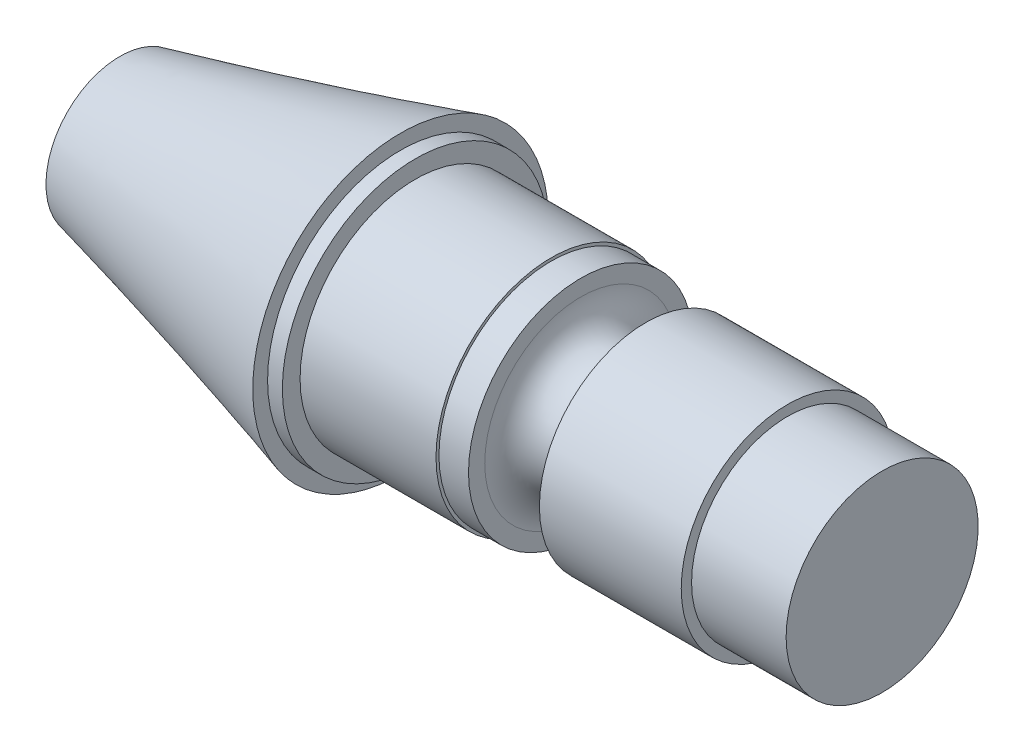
ISO-10303-21;
HEADER;
FILE_DESCRIPTION(('STEP AP214'),'2;1');
FILE_NAME('part.step','',(''),(''),'','','');
FILE_SCHEMA(('AUTOMOTIVE_DESIGN { 1 0 10303 214 1 1 1 1 }'));
ENDSEC;
DATA;
#1=APPLICATION_CONTEXT('core data for automotive mechanical design processes');
#2=APPLICATION_PROTOCOL_DEFINITION('international standard','automotive_design',2000,#1);
#3=PRODUCT_CONTEXT('',#1,'mechanical');
#4=PRODUCT('Part','Part','',(#3));
#5=PRODUCT_RELATED_PRODUCT_CATEGORY('part','',(#4));
#6=PRODUCT_DEFINITION_FORMATION('','',#4);
#7=PRODUCT_DEFINITION_CONTEXT('part definition',#1,'design');
#8=PRODUCT_DEFINITION('design','',#6,#7);
#9=PRODUCT_DEFINITION_SHAPE('','',#8);
#10=(LENGTH_UNIT() NAMED_UNIT(*) SI_UNIT(.MILLI.,.METRE.));
#11=(NAMED_UNIT(*) PLANE_ANGLE_UNIT() SI_UNIT($,.RADIAN.));
#12=(NAMED_UNIT(*) SI_UNIT($,.STERADIAN.) SOLID_ANGLE_UNIT());
#13=UNCERTAINTY_MEASURE_WITH_UNIT(LENGTH_MEASURE(1.E-05),#10,'distance_accuracy_value','');
#14=(GEOMETRIC_REPRESENTATION_CONTEXT(3) GLOBAL_UNCERTAINTY_ASSIGNED_CONTEXT((#13)) GLOBAL_UNIT_ASSIGNED_CONTEXT((#10,
#11,#12)) REPRESENTATION_CONTEXT('',''));
#15=CARTESIAN_POINT('',(0.,0.,0.));
#16=DIRECTION('',(0.,0.,1.));
#17=DIRECTION('',(1.,0.,0.));
#18=AXIS2_PLACEMENT_3D('',#15,#16,#17);
#19=CARTESIAN_POINT('',(163.,12.5,0.));
#20=DIRECTION('',(1.,0.,0.));
#21=DIRECTION('',(0.,0.,-1.));
#22=AXIS2_PLACEMENT_3D('',#19,#20,#21);
#23=PLANE('',#22);
#24=CARTESIAN_POINT('',(163.,45.,0.));
#25=DIRECTION('',(-1.,0.,0.));
#26=DIRECTION('',(0.,0.,1.));
#27=AXIS2_PLACEMENT_3D('',#24,#25,#26);
#28=CIRCLE('',#27,32.5);
#29=CARTESIAN_POINT('',(163.,45.,32.5));
#30=VERTEX_POINT('',#29);
#31=EDGE_CURVE('E11',#30,#30,#28,.T.);
#32=ORIENTED_EDGE('',*,*,#31,.F.);
#33=EDGE_LOOP('',(#32));
#34=FACE_BOUND('',#33,.T.);
#35=ADVANCED_FACE('F109',(#34),#23,.T.);
#36=CARTESIAN_POINT('',(-7.06911857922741,45.,0.));
#37=DIRECTION('',(-1.,0.,0.));
#38=DIRECTION('',(0.,0.,1.));
#39=AXIS2_PLACEMENT_3D('',#36,#37,#38);
#40=CYLINDRICAL_SURFACE('',#39,32.5);
#41=ORIENTED_EDGE('',*,*,#31,.T.);
#42=EDGE_LOOP('',(#41));
#43=FACE_BOUND('',#42,.T.);
#44=CARTESIAN_POINT('',(131.,45.,0.));
#45=DIRECTION('',(-1.,0.,0.));
#46=DIRECTION('',(0.,0.,1.));
#47=AXIS2_PLACEMENT_3D('',#44,#45,#46);
#48=CIRCLE('',#47,32.5);
#49=CARTESIAN_POINT('',(131.,45.,32.5));
#50=VERTEX_POINT('',#49);
#51=EDGE_CURVE('E120',#50,#50,#48,.T.);
#52=ORIENTED_EDGE('',*,*,#51,.F.);
#53=EDGE_LOOP('',(#52));
#54=FACE_BOUND('',#53,.T.);
#55=ADVANCED_FACE('F219',(#43,#54),#40,.T.);
#56=CARTESIAN_POINT('',(131.,9.,0.));
#57=DIRECTION('',(1.,0.,0.));
#58=DIRECTION('',(0.,0.,-1.));
#59=AXIS2_PLACEMENT_3D('',#56,#57,#58);
#60=PLANE('',#59);
#61=ORIENTED_EDGE('',*,*,#51,.T.);
#62=EDGE_LOOP('',(#61));
#63=FACE_BOUND('',#62,.T.);
#64=CARTESIAN_POINT('',(131.,45.,0.));
#65=DIRECTION('',(-1.,0.,0.));
#66=DIRECTION('',(0.,0.,1.));
#67=AXIS2_PLACEMENT_3D('',#64,#65,#66);
#68=CIRCLE('',#67,36.);
#69=CARTESIAN_POINT('',(131.,45.,36.));
#70=VERTEX_POINT('',#69);
#71=EDGE_CURVE('E124',#70,#70,#68,.T.);
#72=ORIENTED_EDGE('',*,*,#71,.F.);
#73=EDGE_LOOP('',(#72));
#74=FACE_BOUND('',#73,.T.);
#75=ADVANCED_FACE('F216',(#63,#74),#60,.T.);
#76=CARTESIAN_POINT('',(-7.06911857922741,45.,0.));
#77=DIRECTION('',(-1.,0.,0.));
#78=DIRECTION('',(0.,0.,1.));
#79=AXIS2_PLACEMENT_3D('',#76,#77,#78);
#80=CYLINDRICAL_SURFACE('',#79,36.);
#81=ORIENTED_EDGE('',*,*,#71,.T.);
#82=EDGE_LOOP('',(#81));
#83=FACE_BOUND('',#82,.T.);
#84=CARTESIAN_POINT('',(83.,45.,0.));
#85=DIRECTION('',(-1.,0.,0.));
#86=DIRECTION('',(0.,0.,1.));
#87=AXIS2_PLACEMENT_3D('',#84,#85,#86);
#88=CIRCLE('',#87,36.);
#89=CARTESIAN_POINT('',(83.,45.,36.));
#90=VERTEX_POINT('',#89);
#91=EDGE_CURVE('E129',#90,#90,#88,.T.);
#92=ORIENTED_EDGE('',*,*,#91,.F.);
#93=EDGE_LOOP('',(#92));
#94=FACE_BOUND('',#93,.T.);
#95=ADVANCED_FACE('F212',(#83,#94),#80,.T.);
#96=CARTESIAN_POINT('',(83.,12.5,0.));
#97=DIRECTION('',(-1.,0.,0.));
#98=DIRECTION('',(0.,0.,1.));
#99=AXIS2_PLACEMENT_3D('',#96,#97,#98);
#100=PLANE('',#99);
#101=ORIENTED_EDGE('',*,*,#91,.T.);
#102=EDGE_LOOP('',(#101));
#103=FACE_BOUND('',#102,.T.);
#104=CARTESIAN_POINT('',(83.,45.,0.));
#105=DIRECTION('',(-1.,0.,0.));
#106=DIRECTION('',(0.,0.,1.));
#107=AXIS2_PLACEMENT_3D('',#104,#105,#106);
#108=CIRCLE('',#107,32.5);
#109=CARTESIAN_POINT('',(83.,45.,32.5));
#110=VERTEX_POINT('',#109);
#111=EDGE_CURVE('E132',#110,#110,#108,.T.);
#112=ORIENTED_EDGE('',*,*,#111,.F.);
#113=EDGE_LOOP('',(#112));
#114=FACE_BOUND('',#113,.T.);
#115=ADVANCED_FACE('F208',(#103,#114),#100,.T.);
#116=CARTESIAN_POINT('',(72.,45.,0.));
#117=DIRECTION('',(-1.,0.,0.));
#118=DIRECTION('',(0.,0.,1.));
#119=AXIS2_PLACEMENT_3D('',#116,#117,#118);
#120=TOROIDAL_SURFACE('',#119,32.5,11.);
#121=ORIENTED_EDGE('',*,*,#111,.T.);
#122=EDGE_LOOP('',(#121));
#123=FACE_BOUND('',#122,.T.);
#124=CARTESIAN_POINT('',(61.,45.,0.));
#125=DIRECTION('',(-1.,0.,0.));
#126=DIRECTION('',(0.,0.,1.));
#127=AXIS2_PLACEMENT_3D('',#124,#125,#126);
#128=CIRCLE('',#127,32.5);
#129=CARTESIAN_POINT('',(61.,45.,32.5));
#130=VERTEX_POINT('',#129);
#131=EDGE_CURVE('E135',#130,#130,#128,.T.);
#132=ORIENTED_EDGE('',*,*,#131,.F.);
#133=EDGE_LOOP('',(#132));
#134=FACE_BOUND('',#133,.T.);
#135=ADVANCED_FACE('F204',(#123,#134),#120,.F.);
#136=CARTESIAN_POINT('',(61.,7.,0.));
#137=DIRECTION('',(1.,0.,0.));
#138=DIRECTION('',(0.,0.,-1.));
#139=AXIS2_PLACEMENT_3D('',#136,#137,#138);
#140=PLANE('',#139);
#141=ORIENTED_EDGE('',*,*,#131,.T.);
#142=EDGE_LOOP('',(#141));
#143=FACE_BOUND('',#142,.T.);
#144=CARTESIAN_POINT('',(61.,45.,0.));
#145=DIRECTION('',(-1.,0.,0.));
#146=DIRECTION('',(0.,0.,1.));
#147=AXIS2_PLACEMENT_3D('',#144,#145,#146);
#148=CIRCLE('',#147,38.);
#149=CARTESIAN_POINT('',(61.,45.,38.));
#150=VERTEX_POINT('',#149);
#151=EDGE_CURVE('E138',#150,#150,#148,.T.);
#152=ORIENTED_EDGE('',*,*,#151,.F.);
#153=EDGE_LOOP('',(#152));
#154=FACE_BOUND('',#153,.T.);
#155=ADVANCED_FACE('F200',(#143,#154),#140,.T.);
#156=CARTESIAN_POINT('',(-7.06911857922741,45.,0.));
#157=DIRECTION('',(-1.,0.,0.));
#158=DIRECTION('',(0.,0.,1.));
#159=AXIS2_PLACEMENT_3D('',#156,#157,#158);
#160=CYLINDRICAL_SURFACE('',#159,38.);
#161=ORIENTED_EDGE('',*,*,#151,.T.);
#162=EDGE_LOOP('',(#161));
#163=FACE_BOUND('',#162,.T.);
#164=CARTESIAN_POINT('',(51.,45.,0.));
#165=DIRECTION('',(-1.,0.,0.));
#166=DIRECTION('',(0.,0.,1.));
#167=AXIS2_PLACEMENT_3D('',#164,#165,#166);
#168=CIRCLE('',#167,38.);
#169=CARTESIAN_POINT('',(51.,45.,38.));
#170=VERTEX_POINT('',#169);
#171=EDGE_CURVE('E141',#170,#170,#168,.T.);
#172=ORIENTED_EDGE('',*,*,#171,.F.);
#173=EDGE_LOOP('',(#172));
#174=FACE_BOUND('',#173,.T.);
#175=ADVANCED_FACE('F196',(#163,#174),#160,.T.);
#176=CARTESIAN_POINT('',(51.,6.,0.));
#177=DIRECTION('',(1.,0.,0.));
#178=DIRECTION('',(0.,0.,-1.));
#179=AXIS2_PLACEMENT_3D('',#176,#177,#178);
#180=PLANE('',#179);
#181=ORIENTED_EDGE('',*,*,#171,.T.);
#182=EDGE_LOOP('',(#181));
#183=FACE_BOUND('',#182,.T.);
#184=CARTESIAN_POINT('',(51.,45.,0.));
#185=DIRECTION('',(-1.,0.,0.));
#186=DIRECTION('',(0.,0.,1.));
#187=AXIS2_PLACEMENT_3D('',#184,#185,#186);
#188=CIRCLE('',#187,39.);
#189=CARTESIAN_POINT('',(51.,45.,39.));
#190=VERTEX_POINT('',#189);
#191=EDGE_CURVE('E144',#190,#190,#188,.T.);
#192=ORIENTED_EDGE('',*,*,#191,.F.);
#193=EDGE_LOOP('',(#192));
#194=FACE_BOUND('',#193,.T.);
#195=ADVANCED_FACE('F192',(#183,#194),#180,.T.);
#196=CARTESIAN_POINT('',(-7.06911857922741,45.,0.));
#197=DIRECTION('',(-1.,0.,0.));
#198=DIRECTION('',(0.,0.,1.));
#199=AXIS2_PLACEMENT_3D('',#196,#197,#198);
#200=CYLINDRICAL_SURFACE('',#199,39.);
#201=ORIENTED_EDGE('',*,*,#191,.T.);
#202=EDGE_LOOP('',(#201));
#203=FACE_BOUND('',#202,.T.);
#204=CARTESIAN_POINT('',(5.,45.,0.));
#205=DIRECTION('',(-1.,0.,0.));
#206=DIRECTION('',(0.,0.,1.));
#207=AXIS2_PLACEMENT_3D('',#204,#205,#206);
#208=CIRCLE('',#207,39.);
#209=CARTESIAN_POINT('',(5.,45.,39.));
#210=VERTEX_POINT('',#209);
#211=EDGE_CURVE('E147',#210,#210,#208,.T.);
#212=ORIENTED_EDGE('',*,*,#211,.F.);
#213=EDGE_LOOP('',(#212));
#214=FACE_BOUND('',#213,.T.);
#215=ADVANCED_FACE('F188',(#203,#214),#200,.T.);
#216=CARTESIAN_POINT('',(5.,0.,0.));
#217=DIRECTION('',(1.,0.,0.));
#218=DIRECTION('',(0.,0.,-1.));
#219=AXIS2_PLACEMENT_3D('',#216,#217,#218);
#220=PLANE('',#219);
#221=ORIENTED_EDGE('',*,*,#211,.T.);
#222=EDGE_LOOP('',(#221));
#223=FACE_BOUND('',#222,.T.);
#224=CARTESIAN_POINT('',(5.,45.,0.));
#225=DIRECTION('',(-1.,0.,0.));
#226=DIRECTION('',(0.,0.,1.));
#227=AXIS2_PLACEMENT_3D('',#224,#225,#226);
#228=CIRCLE('',#227,45.);
#229=CARTESIAN_POINT('',(5.,45.,45.));
#230=VERTEX_POINT('',#229);
#231=EDGE_CURVE('E150',#230,#230,#228,.T.);
#232=ORIENTED_EDGE('',*,*,#231,.F.);
#233=EDGE_LOOP('',(#232));
#234=FACE_BOUND('',#233,.T.);
#235=ADVANCED_FACE('F184',(#223,#234),#220,.T.);
#236=CARTESIAN_POINT('',(-7.06911857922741,45.,0.));
#237=DIRECTION('',(-1.,0.,0.));
#238=DIRECTION('',(0.,0.,1.));
#239=AXIS2_PLACEMENT_3D('',#236,#237,#238);
#240=CYLINDRICAL_SURFACE('',#239,45.);
#241=ORIENTED_EDGE('',*,*,#231,.T.);
#242=EDGE_LOOP('',(#241));
#243=FACE_BOUND('',#242,.T.);
#244=CARTESIAN_POINT('',(0.,45.,0.));
#245=DIRECTION('',(-1.,0.,0.));
#246=DIRECTION('',(0.,0.,1.));
#247=AXIS2_PLACEMENT_3D('',#244,#245,#246);
#248=CIRCLE('',#247,45.);
#249=CARTESIAN_POINT('',(0.,45.,45.));
#250=VERTEX_POINT('',#249);
#251=EDGE_CURVE('E153',#250,#250,#248,.T.);
#252=ORIENTED_EDGE('',*,*,#251,.F.);
#253=EDGE_LOOP('',(#252));
#254=FACE_BOUND('',#253,.T.);
#255=ADVANCED_FACE('F181',(#243,#254),#240,.T.);
#256=CARTESIAN_POINT('',(0.,45.,0.));
#257=DIRECTION('',(-1.,0.,0.));
#258=DIRECTION('',(0.,0.,1.));
#259=AXIS2_PLACEMENT_3D('',#256,#257,#258);
#260=PLANE('',#259);
#261=CARTESIAN_POINT('',(0.,-0.54436628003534,20.6330096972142));
#262=CARTESIAN_POINT('',(0.,-1.03291057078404,19.5546218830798));
#263=CARTESIAN_POINT('',(0.,-1.48303721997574,18.4588137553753));
#264=CARTESIAN_POINT('',(0.,-2.30453315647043,16.2379623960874));
#265=CARTESIAN_POINT('',(0.,-2.67590187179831,15.1129189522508));
#266=CARTESIAN_POINT('',(0.,-3.17248423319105,13.4076072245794));
#267=CARTESIAN_POINT('',(0.,-3.32797922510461,12.8359990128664));
#268=CARTESIAN_POINT('',(0.,-3.6185229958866,11.6876064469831));
#269=CARTESIAN_POINT('',(0.,-3.75357192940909,11.1108221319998));
#270=CARTESIAN_POINT('',(0.,-4.1277926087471,9.37377499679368));
#271=CARTESIAN_POINT('',(0.,-4.33606013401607,8.20674276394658));
#272=CARTESIAN_POINT('',(0.,-4.70037722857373,5.64235801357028));
#273=CARTESIAN_POINT('',(0.,-4.83949920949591,4.2425560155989));
#274=CARTESIAN_POINT('',(0.,-4.95931351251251,2.13811415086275));
#275=CARTESIAN_POINT('',(0.,-4.98443685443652,1.43572294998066));
#276=CARTESIAN_POINT('',(0.,-5.00499208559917,0.0304601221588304));
#277=CARTESIAN_POINT('',(0.,-5.00042411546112,-0.672411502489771));
#278=CARTESIAN_POINT('',(0.,-4.96169511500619,-2.07755463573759));
#279=CARTESIAN_POINT('',(0.,-4.92752440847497,-2.77982587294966));
#280=CARTESIAN_POINT('',(0.,-4.82965186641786,-4.18231189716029));
#281=CARTESIAN_POINT('',(0.,-4.76594999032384,-4.88252668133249));
#282=CARTESIAN_POINT('',(0.,-4.60910560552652,-6.2796329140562));
#283=CARTESIAN_POINT('',(0.,-4.5159639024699,-6.97652445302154));
#284=CARTESIAN_POINT('',(0.,-4.30029997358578,-8.36574242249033));
#285=CARTESIAN_POINT('',(0.,-4.17777781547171,-9.05806886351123));
#286=CARTESIAN_POINT('',(0.,-3.90365642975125,-10.4367977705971));
#287=CARTESIAN_POINT('',(0.,-3.75206343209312,-11.1232014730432));
#288=CARTESIAN_POINT('',(0.,-3.4201377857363,-12.4889808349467));
#289=CARTESIAN_POINT('',(0.,-3.23980502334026,-13.1683564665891));
#290=CARTESIAN_POINT('',(0.,-2.65615332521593,-15.1941378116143));
#291=CARTESIAN_POINT('',(0.,-2.21012123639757,-16.5284981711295));
#292=CARTESIAN_POINT('',(0.,-1.20697115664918,-19.1546621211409));
#293=CARTESIAN_POINT('',(0.,-0.649862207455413,-20.446469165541));
#294=CARTESIAN_POINT('',(0.,0.265564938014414,-22.3453443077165));
#295=CARTESIAN_POINT('',(0.,0.584041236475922,-22.971897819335));
#296=CARTESIAN_POINT('',(0.,1.24710446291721,-24.2110813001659));
#297=CARTESIAN_POINT('',(0.,1.5916912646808,-24.8237113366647));
#298=CARTESIAN_POINT('',(0.,2.30660485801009,-26.0341788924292));
#299=CARTESIAN_POINT('',(0.,2.67694487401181,-26.6320085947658));
#300=CARTESIAN_POINT('',(0.,3.44256017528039,-27.8114875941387));
#301=CARTESIAN_POINT('',(0.,3.83783554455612,-28.3931368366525));
#302=CARTESIAN_POINT('',(0.,4.65253228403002,-29.5392682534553));
#303=CARTESIAN_POINT('',(0.,5.07195361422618,-30.1037504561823));
#304=CARTESIAN_POINT('',(0.,5.93418998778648,-31.2145551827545));
#305=CARTESIAN_POINT('',(0.,6.3770050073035,-31.7608777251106));
#306=CARTESIAN_POINT('',(0.,7.28527377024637,-32.8343887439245));
#307=CARTESIAN_POINT('',(0.,7.75072793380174,-33.361576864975));
#308=CARTESIAN_POINT('',(0.,8.70351365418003,-34.3957926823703));
#309=CARTESIAN_POINT('',(0.,9.19084517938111,-34.9028204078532));
#310=CARTESIAN_POINT('',(0.,10.1864785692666,-35.8958648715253));
#311=CARTESIAN_POINT('',(0.,10.6947803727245,-36.381881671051));
#312=CARTESIAN_POINT('',(0.,11.731357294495,-37.3320545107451));
#313=CARTESIAN_POINT('',(0.,12.2596324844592,-37.7962104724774));
#314=CARTESIAN_POINT('',(0.,13.8726232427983,-39.1542786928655));
#315=CARTESIAN_POINT('',(0.,14.9861383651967,-40.0144237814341));
#316=CARTESIAN_POINT('',(0.,17.2816289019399,-41.637457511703));
#317=CARTESIAN_POINT('',(0.,18.4636043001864,-42.4003461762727));
#318=CARTESIAN_POINT('',(0.,20.8876917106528,-43.8242049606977));
#319=CARTESIAN_POINT('',(0.,22.1298035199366,-44.4851754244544));
#320=CARTESIAN_POINT('',(0.,24.0311044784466,-45.396144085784));
#321=CARTESIAN_POINT('',(0.,24.6712998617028,-45.6864134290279));
#322=CARTESIAN_POINT('',(0.,25.9634249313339,-46.2396745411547));
#323=CARTESIAN_POINT('',(0.,26.6153546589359,-46.5026662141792));
#324=CARTESIAN_POINT('',(0.,27.9295657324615,-47.0009150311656));
#325=CARTESIAN_POINT('',(0.,28.5918450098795,-47.236177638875));
#326=CARTESIAN_POINT('',(0.,29.9257182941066,-47.6786285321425));
#327=CARTESIAN_POINT('',(0.,30.5973122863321,-47.88581686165));
#328=CARTESIAN_POINT('',(0.,31.9486334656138,-48.2717236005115));
#329=CARTESIAN_POINT('',(0.,32.6283606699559,-48.4504419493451));
#330=CARTESIAN_POINT('',(0.,33.9947595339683,-48.7789860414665));
#331=CARTESIAN_POINT('',(0.,34.68143119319,-48.9288117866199));
#332=CARTESIAN_POINT('',(0.,36.0604898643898,-49.1993746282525));
#333=CARTESIAN_POINT('',(0.,36.7528768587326,-49.3201118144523));
#334=CARTESIAN_POINT('',(0.,38.14207233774,-49.5323429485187));
#335=CARTESIAN_POINT('',(0.,38.8388808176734,-49.6238369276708));
#336=CARTESIAN_POINT('',(0.,40.9340983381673,-49.8541809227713));
#337=CARTESIAN_POINT('',(0.,42.3376050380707,-49.9489528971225));
#338=CARTESIAN_POINT('',(0.,45.1480952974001,-50.0196335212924));
#339=CARTESIAN_POINT('',(0.,46.5550798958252,-49.995500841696));
#340=CARTESIAN_POINT('',(0.,48.6598719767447,-49.8707291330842));
#341=CARTESIAN_POINT('',(0.,49.360555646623,-49.8143715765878));
#342=CARTESIAN_POINT('',(0.,50.759149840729,-49.6721835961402));
#343=CARTESIAN_POINT('',(0.,51.457059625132,-49.5863457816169));
#344=CARTESIAN_POINT('',(0.,52.8484998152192,-49.3852774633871));
#345=CARTESIAN_POINT('',(0.,53.5420309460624,-49.2700519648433));
#346=CARTESIAN_POINT('',(0.,54.923673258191,-49.010399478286));
#347=CARTESIAN_POINT('',(0.,55.6117839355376,-48.8659698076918));
#348=CARTESIAN_POINT('',(0.,56.9812928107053,-48.5482691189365));
#349=CARTESIAN_POINT('',(0.,57.6626911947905,-48.3749989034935));
#350=CARTESIAN_POINT('',(0.,59.0175739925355,-47.9999345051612));
#351=CARTESIAN_POINT('',(0.,59.6910586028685,-47.7981410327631));
#352=CARTESIAN_POINT('',(0.,61.0290443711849,-47.3663172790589));
#353=CARTESIAN_POINT('',(0.,61.6935439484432,-47.1362820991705));
#354=CARTESIAN_POINT('',(0.,63.0122224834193,-46.6483114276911));
#355=CARTESIAN_POINT('',(0.,63.6664013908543,-46.3903758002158));
#356=CARTESIAN_POINT('',(0.,64.96329243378,-45.8471407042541));
#357=CARTESIAN_POINT('',(0.,65.6060046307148,-45.5618413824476));
#358=CARTESIAN_POINT('',(0.,66.8788467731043,-44.9644374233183));
#359=CARTESIAN_POINT('',(0.,67.5089766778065,-44.652332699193));
#360=CARTESIAN_POINT('',(0.,68.7555501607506,-44.0018613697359));
#361=CARTESIAN_POINT('',(0.,69.3719936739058,-43.6634946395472));
#362=CARTESIAN_POINT('',(0.,70.5900116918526,-42.9610767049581));
#363=CARTESIAN_POINT('',(0.,71.191586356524,-42.5970257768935));
#364=CARTESIAN_POINT('',(0.,72.9723533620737,-41.4672327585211));
#365=CARTESIAN_POINT('',(0.,74.1278609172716,-40.6637084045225));
#366=CARTESIAN_POINT('',(0.,76.3666873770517,-38.9627533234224));
#367=CARTESIAN_POINT('',(0.,77.4500403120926,-38.065367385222));
#368=CARTESIAN_POINT('',(0.,79.0151873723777,-36.6533963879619));
#369=CARTESIAN_POINT('',(0.,79.5269757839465,-36.1717006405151));
#370=CARTESIAN_POINT('',(0.,80.5297927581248,-35.1871008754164));
#371=CARTESIAN_POINT('',(0.,81.020821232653,-34.6841967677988));
#372=CARTESIAN_POINT('',(0.,81.9812644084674,-33.658177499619));
#373=CARTESIAN_POINT('',(0.,82.4506792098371,-33.1350624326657));
#374=CARTESIAN_POINT('',(0.,83.3670806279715,-32.0695406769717));
#375=CARTESIAN_POINT('',(0.,83.8140672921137,-31.527134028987));
#376=CARTESIAN_POINT('',(0.,84.6847918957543,-30.4239682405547));
#377=CARTESIAN_POINT('',(0.,85.108529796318,-29.8632090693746));
#378=CARTESIAN_POINT('',(0.,85.9319152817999,-28.7242742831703));
#379=CARTESIAN_POINT('',(0.,86.331562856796,-28.1460986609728));
#380=CARTESIAN_POINT('',(0.,87.1061288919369,-26.9734060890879));
#381=CARTESIAN_POINT('',(0.,87.4810471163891,-26.3788889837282));
#382=CARTESIAN_POINT('',(0.,88.2055304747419,-25.1746096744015));
#383=CARTESIAN_POINT('',(0.,88.5550956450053,-24.5648474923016));
#384=CARTESIAN_POINT('',(0.,89.2282461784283,-23.3311691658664));
#385=CARTESIAN_POINT('',(0.,89.5518329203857,-22.707253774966));
#386=CARTESIAN_POINT('',(0.,90.1724184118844,-21.446322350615));
#387=CARTESIAN_POINT('',(0.,90.469414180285,-20.809304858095));
#388=CARTESIAN_POINT('',(0.,91.3196030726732,-18.8802897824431));
#389=CARTESIAN_POINT('',(0.,91.8321850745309,-17.5699863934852));
#390=CARTESIAN_POINT('',(0.,92.5169118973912,-15.5763612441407));
#391=CARTESIAN_POINT('',(0.,92.7311380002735,-14.9070919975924));
#392=CARTESIAN_POINT('',(0.,93.1312998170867,-13.5598947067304));
#393=CARTESIAN_POINT('',(0.,93.3172284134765,-12.8819645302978));
#394=CARTESIAN_POINT('',(0.,93.6603422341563,-11.5185715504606));
#395=CARTESIAN_POINT('',(0.,93.8175148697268,-10.8331055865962));
#396=CARTESIAN_POINT('',(0.,94.102777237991,-9.45607819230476));
#397=CARTESIAN_POINT('',(0.,94.2308642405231,-8.76451619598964));
#398=CARTESIAN_POINT('',(0.,94.4577921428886,-7.37662902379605));
#399=CARTESIAN_POINT('',(0.,94.5566337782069,-6.6803039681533));
#400=CARTESIAN_POINT('',(0.,94.7249063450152,-5.28413583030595));
#401=CARTESIAN_POINT('',(0.,94.7943382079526,-4.58429286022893));
#402=CARTESIAN_POINT('',(0.,94.903636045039,-3.18228153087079));
#403=CARTESIAN_POINT('',(0.,94.9435019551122,-2.48011316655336));
#404=CARTESIAN_POINT('',(0.,94.9935010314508,-1.07476376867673));
#405=CARTESIAN_POINT('',(0.,95.003633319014,-0.371582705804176));
#406=CARTESIAN_POINT('',(0.,94.9895029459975,1.73769489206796));
#407=CARTESIAN_POINT('',(0.,94.9207391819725,3.14386201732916));
#408=CARTESIAN_POINT('',(0.,94.7291625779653,5.2441666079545));
#409=CARTESIAN_POINT('',(0.,94.6505782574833,5.94270340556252));
#410=CARTESIAN_POINT('',(0.,94.4640088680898,7.33584797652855));
#411=CARTESIAN_POINT('',(0.,94.3560244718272,8.03045583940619));
#412=CARTESIAN_POINT('',(0.,93.9881829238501,10.1064290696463));
#413=CARTESIAN_POINT('',(0.,93.6844103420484,11.4802408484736));
#414=CARTESIAN_POINT('',(0.,92.9624699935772,14.1974667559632));
#415=CARTESIAN_POINT('',(0.,92.544302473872,15.5408809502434));
#416=CARTESIAN_POINT('',(0.,91.8332736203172,17.5256708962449));
#417=CARTESIAN_POINT('',(0.,91.5822700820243,18.182280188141));
#418=CARTESIAN_POINT('',(0.,91.0527783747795,19.4843137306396));
#419=CARTESIAN_POINT('',(0.,90.7742896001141,20.1297377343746));
#420=CARTESIAN_POINT('',(0.,89.8985315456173,22.0472983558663));
#421=CARTESIAN_POINT('',(0.,89.2607545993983,23.3013257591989));
#422=CARTESIAN_POINT('',(0.,88.2269482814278,25.1382269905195));
#423=CARTESIAN_POINT('',(0.,87.8694705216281,25.7431984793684));
#424=CARTESIAN_POINT('',(0.,87.129177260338,26.937648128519));
#425=CARTESIAN_POINT('',(0.,86.746355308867,27.5271222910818));
#426=CARTESIAN_POINT('',(0.,85.5611924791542,29.2704105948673));
#427=CARTESIAN_POINT('',(0.,84.7219048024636,30.3995342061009));
#428=CARTESIAN_POINT('',(0.,83.3943639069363,32.0369125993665));
#429=CARTESIAN_POINT('',(0.,82.9403429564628,32.5733962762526));
#430=CARTESIAN_POINT('',(0.,82.0100815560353,33.6267205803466));
#431=CARTESIAN_POINT('',(0.,81.5338436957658,34.1435634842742));
#432=CARTESIAN_POINT('',(0.,80.5597175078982,35.1569083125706));
#433=CARTESIAN_POINT('',(0.,80.0618182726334,35.6533997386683));
#434=CARTESIAN_POINT('',(0.,79.0457117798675,36.6248130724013));
#435=CARTESIAN_POINT('',(0.,78.5275111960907,37.0997419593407));
#436=CARTESIAN_POINT('',(0.,77.4715824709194,38.0273714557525));
#437=CARTESIAN_POINT('',(0.,76.9338543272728,38.4800720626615));
#438=CARTESIAN_POINT('',(0.,75.839638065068,39.3625727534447));
#439=CARTESIAN_POINT('',(0.,75.2831438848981,39.7923653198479));
#440=CARTESIAN_POINT('',(0.,74.1525873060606,40.6279646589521));
#441=CARTESIAN_POINT('',(0.,73.5785285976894,41.0337764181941));
#442=CARTESIAN_POINT('',(0.,72.4137851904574,41.820821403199));
#443=CARTESIAN_POINT('',(0.,71.8230985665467,42.2020517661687));
#444=CARTESIAN_POINT('',(0.,70.0277767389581,43.3078857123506));
#445=CARTESIAN_POINT('',(0.,68.7995434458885,43.994880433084));
#446=CARTESIAN_POINT('',(0.,66.9173270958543,44.9458726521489));
#447=CARTESIAN_POINT('',(0.,66.2830730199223,45.2497025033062));
#448=CARTESIAN_POINT('',(0.,65.00244667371,45.8301941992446));
#449=CARTESIAN_POINT('',(0.,64.3560775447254,46.1068629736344));
#450=CARTESIAN_POINT('',(0.,62.4001253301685,46.8956787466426));
#451=CARTESIAN_POINT('',(0.,61.0735776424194,47.3666956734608));
#452=CARTESIAN_POINT('',(0.,59.0580957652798,47.9881422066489));
#453=CARTESIAN_POINT('',(0.,58.3819105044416,48.1811289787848));
#454=CARTESIAN_POINT('',(0.,57.0219889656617,48.53838834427));
#455=CARTESIAN_POINT('',(0.,56.3382528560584,48.7026615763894));
#456=CARTESIAN_POINT('',(0.,54.2776152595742,49.1518837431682));
#457=CARTESIAN_POINT('',(0.,52.8909985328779,49.3933233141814));
#458=CARTESIAN_POINT('',(0.,50.1030470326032,49.7586726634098));
#459=CARTESIAN_POINT('',(0.,48.7017196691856,49.8826389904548));
#460=CARTESIAN_POINT('',(0.,46.5959317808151,49.9795741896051));
#461=CARTESIAN_POINT('',(0.,45.8932953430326,49.9970473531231));
#462=CARTESIAN_POINT('',(0.,44.4879180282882,50.002336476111));
#463=CARTESIAN_POINT('',(0.,43.7851771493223,49.9901517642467));
#464=CARTESIAN_POINT('',(0.,41.6786639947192,49.9092224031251));
#465=CARTESIAN_POINT('',(0.,40.2762396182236,49.7961190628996));
#466=CARTESIAN_POINT('',(0.,38.1841049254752,49.5383068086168));
#467=CARTESIAN_POINT('',(0.,37.4886116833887,49.4376698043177));
#468=CARTESIAN_POINT('',(0.,36.1023196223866,49.207066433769));
#469=CARTESIAN_POINT('',(0.,35.411522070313,49.0770924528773));
#470=CARTESIAN_POINT('',(0.,33.3484859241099,48.6436898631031));
#471=CARTESIAN_POINT('',(0.,31.9850355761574,48.2967104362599));
#472=CARTESIAN_POINT('',(0.,29.9658710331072,47.6913701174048));
#473=CARTESIAN_POINT('',(0.,29.2970623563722,47.4754097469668));
#474=CARTESIAN_POINT('',(0.,27.9691682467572,47.0154634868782));
#475=CARTESIAN_POINT('',(0.,27.3100817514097,46.7714806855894));
#476=CARTESIAN_POINT('',(0.,26.0026010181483,46.2558045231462));
#477=CARTESIAN_POINT('',(0.,25.3542102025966,45.9841024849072));
#478=CARTESIAN_POINT('',(0.,24.0696621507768,45.413739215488));
#479=CARTESIAN_POINT('',(0.,23.4335018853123,45.115084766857));
#480=CARTESIAN_POINT('',(0.,21.5445182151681,44.1792492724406));
#481=CARTESIAN_POINT('',(0.,20.3110536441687,43.5021414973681));
#482=CARTESIAN_POINT('',(0.,18.5070743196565,42.4102689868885));
#483=CARTESIAN_POINT('',(0.,17.91318065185,42.0334132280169));
#484=CARTESIAN_POINT('',(0.,16.7417866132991,41.2549323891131));
#485=CARTESIAN_POINT('',(0.,16.1642860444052,40.8533076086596));
#486=CARTESIAN_POINT('',(0.,15.0267020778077,40.0260809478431));
#487=CARTESIAN_POINT('',(0.,14.4666194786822,39.6004779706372));
#488=CARTESIAN_POINT('',(0.,13.3648750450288,38.7260618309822));
#489=CARTESIAN_POINT('',(0.,12.8232131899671,38.2772486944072));
#490=CARTESIAN_POINT('',(0.,11.759588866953,37.3574126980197));
#491=CARTESIAN_POINT('',(0.,11.2376157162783,36.8864022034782));
#492=CARTESIAN_POINT('',(0.,10.2140872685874,35.9227656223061));
#493=CARTESIAN_POINT('',(0.,9.7125321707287,35.4301393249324));
#494=CARTESIAN_POINT('',(0.,8.23985642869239,33.9213598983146));
#495=CARTESIAN_POINT('',(0.,7.30031326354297,32.8739496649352));
#496=CARTESIAN_POINT('',(0.,5.70790064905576,30.9408923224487));
#497=CARTESIAN_POINT('',(0.,5.03720367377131,30.0697975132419));
#498=CARTESIAN_POINT('',(0.,3.75485864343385,28.2852510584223));
#499=CARTESIAN_POINT('',(0.,3.14320261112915,27.3718051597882));
#500=CARTESIAN_POINT('',(0.,1.98155223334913,25.5070450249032));
#501=CARTESIAN_POINT('',(0.,1.43153369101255,24.5557458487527));
#502=CARTESIAN_POINT('',(0.,0.395195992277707,22.6189673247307));
#503=CARTESIAN_POINT('',(0.,-0.0911186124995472,21.6334855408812));
#504=CARTESIAN_POINT('',(0.,-0.54436628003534,20.6330096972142));
#505=B_SPLINE_CURVE_WITH_KNOTS('',3,(#261,#262,#263,#264,#265,#266,#267,#268,#269,#270,#271,
#272,#273,#274,#275,#276,#277,#278,#279,#280,#281,#282,#283,#284,#285,#286,#287,#288,#289,#290,
#291,#292,#293,#294,#295,#296,#297,#298,#299,#300,#301,#302,#303,#304,#305,#306,#307,#308,#309,
#310,#311,#312,#313,#314,#315,#316,#317,#318,#319,#320,#321,#322,#323,#324,#325,#326,#327,#328,
#329,#330,#331,#332,#333,#334,#335,#336,#337,#338,#339,#340,#341,#342,#343,#344,#345,#346,#347,
#348,#349,#350,#351,#352,#353,#354,#355,#356,#357,#358,#359,#360,#361,#362,#363,#364,#365,#366,
#367,#368,#369,#370,#371,#372,#373,#374,#375,#376,#377,#378,#379,#380,#381,#382,#383,#384,#385,
#386,#387,#388,#389,#390,#391,#392,#393,#394,#395,#396,#397,#398,#399,#400,#401,#402,#403,#404,
#405,#406,#407,#408,#409,#410,#411,#412,#413,#414,#415,#416,#417,#418,#419,#420,#421,#422,#423,
#424,#425,#426,#427,#428,#429,#430,#431,#432,#433,#434,#435,#436,#437,#438,#439,#440,#441,#442,
#443,#444,#445,#446,#447,#448,#449,#450,#451,#452,#453,#454,#455,#456,#457,#458,#459,#460,#461,
#462,#463,#464,#465,#466,#467,#468,#469,#470,#471,#472,#473,#474,#475,#476,#477,#478,#479,#480,
#481,#482,#483,#484,#485,#486,#487,#488,#489,#490,#491,#492,#493,#494,#495,#496,#497,#498,#499,
#500,#501,#502,#503,#504),.UNSPECIFIED.,.T.,.F.,(4,2,2,2,2,2,2,2,2,2,2,2,2,2,2,2,2,2,2,2,2,2,2,
2,2,2,2,2,2,2,2,2,2,2,2,2,2,2,2,2,2,2,2,2,2,2,2,2,2,2,2,2,2,2,2,2,2,2,2,2,2,2,2,2,2,2,2,2,2,2,2,
2,2,2,2,2,2,2,2,2,2,2,2,2,2,2,2,2,2,2,2,2,2,2,2,2,2,2,2,2,2,2,2,2,2,2,2,2,2,2,2,2,2,2,2,2,2,2,2,
2,2,4),(0.,3.55100550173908,7.10203679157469,8.87885812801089,10.6556660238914,14.2090473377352,
18.4236267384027,20.5316390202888,22.6396413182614,24.7483329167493,26.857027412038,
28.9656642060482,31.0742961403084,33.1824766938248,35.2906655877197,39.5061280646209,
43.7212475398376,45.8292774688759,47.9372972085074,50.0464075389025,52.1555249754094,
54.2646389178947,56.3737507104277,58.4829016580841,60.592049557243,62.7011912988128,
64.8103406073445,69.0259602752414,73.2415789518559,77.4571834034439,79.5654516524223,
81.673727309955,83.7815868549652,85.8894431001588,87.9973038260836,90.1051644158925,
92.2130185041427,94.3208703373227,98.5356428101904,102.751880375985,104.860203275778,
106.969055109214,109.077548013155,111.186234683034,113.294862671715,115.403438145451,
117.512379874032,119.621331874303,121.730272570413,123.839220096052,125.948177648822,
128.057112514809,132.274064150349,136.489012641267,138.59695167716,140.704899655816,
142.812837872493,144.920771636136,147.028708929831,149.136647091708,151.244605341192,
153.352560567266,155.460403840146,157.568483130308,161.783472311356,163.891167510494,
165.999391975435,168.108537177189,170.217880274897,172.327170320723,174.436393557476,
176.54562136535,178.654911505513,182.872483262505,184.980821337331,187.089111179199,
191.304799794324,195.520479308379,197.628765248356,199.737097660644,203.951849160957,
206.059425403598,208.167540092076,212.382246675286,214.490225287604,216.597958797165,
218.706766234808,220.814886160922,222.923006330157,225.031814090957,227.14018179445,
229.248794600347,233.46477033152,235.574075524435,237.682841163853,241.899971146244,
244.009033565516,246.118049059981,250.335185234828,254.550290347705,256.658287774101,
258.766332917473,262.981340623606,265.089039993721,267.197287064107,271.412068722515,
273.520031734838,275.627762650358,277.736155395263,279.844019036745,284.059301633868,
286.168940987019,288.278554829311,290.388265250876,292.497973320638,294.606519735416,
296.715086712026,300.930590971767,304.22655041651,307.522063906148,310.81627911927,
314.110729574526),.UNSPECIFIED.);
#506=CARTESIAN_POINT('',(0.,90.5442716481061,-20.632966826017));
#507=VERTEX_POINT('',#506);
#508=EDGE_CURVE('E112',#507,#507,#505,.F.);
#509=ORIENTED_EDGE('',*,*,#508,.F.);
#510=EDGE_LOOP('',(#509));
#511=FACE_BOUND('',#510,.T.);
#512=ORIENTED_EDGE('',*,*,#251,.T.);
#513=EDGE_LOOP('',(#512));
#514=FACE_BOUND('',#513,.T.);
#515=ADVANCED_FACE('F176',(#511,#514),#260,.F.);
#516=CARTESIAN_POINT('',(-95.,45.,0.));
#517=DIRECTION('',(-1.,0.,0.));
#518=DIRECTION('',(0.,0.,1.));
#519=AXIS2_PLACEMENT_3D('',#516,#517,#518);
#520=PLANE('',#519);
#521=CARTESIAN_POINT('',(-95.,45.,0.));
#522=DIRECTION('',(-1.,0.,0.));
#523=DIRECTION('',(0.,0.,1.));
#524=AXIS2_PLACEMENT_3D('',#521,#522,#523);
#525=CIRCLE('',#524,25.);
#526=CARTESIAN_POINT('',(-95.,67.7265414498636,-10.4165403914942));
#527=VERTEX_POINT('',#526);
#528=EDGE_CURVE('E158',#527,#527,#525,.T.);
#529=ORIENTED_EDGE('',*,*,#528,.T.);
#530=EDGE_LOOP('',(#529));
#531=FACE_BOUND('',#530,.T.);
#532=ADVANCED_FACE('F166',(#531),#520,.T.);
#533=CARTESIAN_POINT('',(0.,90.5442716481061,-20.632966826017));
#534=CARTESIAN_POINT('',(-14.9455860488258,86.4268560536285,-19.1222035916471));
#535=CARTESIAN_POINT('',(-46.5023578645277,78.3183761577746,-15.8252853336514));
#536=CARTESIAN_POINT('',(-78.2789193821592,71.215035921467,-12.3112526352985));
#537=CARTESIAN_POINT('',(-95.,67.7265414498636,-10.4165403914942));
#538=CARTESIAN_POINT('',(0.,89.1938472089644,-23.6138322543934));
#539=CARTESIAN_POINT('',(-14.9455861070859,85.1752995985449,-21.8336096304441));
#540=CARTESIAN_POINT('',(-46.5023578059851,77.282634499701,-18.0059222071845));
#541=CARTESIAN_POINT('',(-78.2789194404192,70.4092341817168,-14.0270930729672));
#542=CARTESIAN_POINT('',(-95.,67.044780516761,-11.9039889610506));
#543=CARTESIAN_POINT('',(0.,85.9060216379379,-29.3095560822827));
#544=CARTESIAN_POINT('',(-14.9456345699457,82.1384446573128,-27.0099629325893));
#545=CARTESIAN_POINT('',(-46.5023091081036,74.7818126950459,-22.1634937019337));
#546=CARTESIAN_POINT('',(-78.2789679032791,68.4594509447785,-17.2992969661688));
#547=CARTESIAN_POINT('',(-95.0000000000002,65.3875164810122,-14.7435889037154));
#548=CARTESIAN_POINT('',(0.,79.4018867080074,-36.726745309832));
#549=CARTESIAN_POINT('',(-14.9455066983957,76.1550351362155,-33.735899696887));
#550=CARTESIAN_POINT('',(-46.5024375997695,69.8852904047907,-27.5472727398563));
#551=CARTESIAN_POINT('',(-78.278840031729,64.6346883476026,-21.545029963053));
#552=CARTESIAN_POINT('',(-94.9999999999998,62.1213704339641,-18.4404321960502));
#553=CARTESIAN_POINT('',(0.,71.5758926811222,-42.732519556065));
#554=CARTESIAN_POINT('',(-14.9456848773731,68.9752769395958,-39.1663393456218));
#555=CARTESIAN_POINT('',(-46.5022585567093,64.0333269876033,-31.8735270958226));
#556=CARTESIAN_POINT('',(-78.2790182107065,60.0529219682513,-24.959548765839));
#557=CARTESIAN_POINT('',(-95.,58.1923591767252,-21.4223359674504));
#558=CARTESIAN_POINT('',(0.,62.7285218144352,-47.0961195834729));
#559=CARTESIAN_POINT('',(-14.9454912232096,60.8732798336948,-43.090398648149));
#560=CARTESIAN_POINT('',(-46.5024531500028,57.4490376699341,-34.9735491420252));
#561=CARTESIAN_POINT('',(-78.2788245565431,54.8953749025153,-27.4190417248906));
#562=CARTESIAN_POINT('',(-95.0000000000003,53.7616646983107,-23.5890835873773));
#563=CARTESIAN_POINT('',(0.,53.199896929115,-49.6498457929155));
#564=CARTESIAN_POINT('',(-14.9456724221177,52.1619139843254,-45.3598555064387));
#565=CARTESIAN_POINT('',(-46.5022710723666,50.3869934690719,-36.7309580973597));
#566=CARTESIAN_POINT('',(-78.279005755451,49.3556287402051,-28.8202638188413));
#567=CARTESIAN_POINT('',(-95.,48.9904689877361,-24.840458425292));
#568=CARTESIAN_POINT('',(0.,43.3561271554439,-50.2955572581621));
#569=CARTESIAN_POINT('',(-14.945495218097,43.1750863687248,-45.8848018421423));
#570=CARTESIAN_POINT('',(-46.5024491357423,43.1176839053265,-37.0754146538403));
#571=CARTESIAN_POINT('',(-78.2788285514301,43.6491813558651,-29.1186425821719));
#572=CARTESIAN_POINT('',(-94.9999999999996,44.0672696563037,-25.1463183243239));
#573=CARTESIAN_POINT('',(0.,33.5755425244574,-49.008439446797));
#574=CARTESIAN_POINT('',(-14.9456756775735,34.2583044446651,-44.6478102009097));
#575=CARTESIAN_POINT('',(-46.5022678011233,35.9206321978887,-35.9965150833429));
#576=CARTESIAN_POINT('',(-78.2790090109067,37.99498564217,-28.2931979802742));
#577=CARTESIAN_POINT('',(-94.9999999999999,39.1805643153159,-24.4765211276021));
#578=CARTESIAN_POINT('',(0.,24.2339847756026,-45.8379544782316));
#579=CARTESIAN_POINT('',(-14.9455002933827,25.7546227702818,-41.6936779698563));
#580=CARTESIAN_POINT('',(-46.502444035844,29.0728050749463,-33.5329038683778));
#581=CARTESIAN_POINT('',(-78.2788336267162,32.6088970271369,-26.3851572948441));
#582=CARTESIAN_POINT('',(-95.0000000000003,34.5153961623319,-22.8751734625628));
#583=CARTESIAN_POINT('',(0.,15.690457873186,-40.9059419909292));
#584=CARTESIAN_POINT('',(-14.9456759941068,17.9899895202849,-37.1385270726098));
#585=CARTESIAN_POINT('',(-46.502267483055,22.836492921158,-29.7819222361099));
#586=CARTESIAN_POINT('',(-78.2790093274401,27.7008898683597,-23.4588203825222));
#587=CARTESIAN_POINT('',(-95.,30.2568083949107,-20.3863819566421));
#588=CARTESIAN_POINT('',(0.,8.27327820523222,-34.4019385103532));
#589=CARTESIAN_POINT('',(-14.9454928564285,11.2641483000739,-31.1550462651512));
#590=CARTESIAN_POINT('',(-46.5024515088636,17.4527473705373,-24.8852911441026));
#591=CARTESIAN_POINT('',(-78.2788261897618,23.4548484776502,-19.6348756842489));
#592=CARTESIAN_POINT('',(-94.9999999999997,26.5593284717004,-17.1216826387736));
#593=CARTESIAN_POINT('',(0.,2.26748927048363,-26.5758876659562));
#594=CARTESIAN_POINT('',(-14.9456738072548,5.83371629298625,-23.9752448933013));
#595=CARTESIAN_POINT('',(-46.5022696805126,13.1265542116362,-19.03331063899));
#596=CARTESIAN_POINT('',(-78.279007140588,20.0403793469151,-15.0530608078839));
#597=CARTESIAN_POINT('',(-95.,23.577483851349,-13.1926115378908));
#598=CARTESIAN_POINT('',(0.,-2.09611627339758,-17.7285466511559));
#599=CARTESIAN_POINT('',(-14.945498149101,1.90960309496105,-15.8733763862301));
#600=CARTESIAN_POINT('',(-46.5024461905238,10.0264602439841,-12.4491584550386));
#601=CARTESIAN_POINT('',(-78.2788314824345,17.5810185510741,-9.89528211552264));
#602=CARTESIAN_POINT('',(-95.0000000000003,21.4110069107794,-8.76140524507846));
#603=CARTESIAN_POINT('',(0.,-4.64983923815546,-8.19990467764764));
#604=CARTESIAN_POINT('',(-14.9456769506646,-0.359869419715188,-7.16197232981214));
#605=CARTESIAN_POINT('',(-46.5022665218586,8.26901838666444,-5.38707206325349));
#606=CARTESIAN_POINT('',(-78.279010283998,16.1797767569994,-4.35556944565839));
#607=CARTESIAN_POINT('',(-95.0000000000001,20.1596300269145,-3.99030035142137));
#608=CARTESIAN_POINT('',(0.,-5.29557076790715,1.64383695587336));
#609=CARTESIAN_POINT('',(-14.9454936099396,-0.884804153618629,1.82489797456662));
#610=CARTESIAN_POINT('',(-46.5024507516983,7.92459611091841,1.88231329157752));
#611=CARTESIAN_POINT('',(-78.2788269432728,15.8813575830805,1.3507743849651));
#612=CARTESIAN_POINT('',(-94.9999999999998,19.8536718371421,0.93265157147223));
#613=CARTESIAN_POINT('',(0.,-4.00843432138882,11.4244602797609));
#614=CARTESIAN_POINT('',(-14.9456760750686,0.352192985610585,10.7417025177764));
#615=CARTESIAN_POINT('',(-46.5022674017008,9.00348012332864,9.07937208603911));
#616=CARTESIAN_POINT('',(-78.279009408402,16.7067831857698,7.00499496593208));
#617=CARTESIAN_POINT('',(-95.0000000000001,20.5234509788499,5.81939895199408));
#618=CARTESIAN_POINT('',(0.,-0.837955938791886,20.7660149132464));
#619=CARTESIAN_POINT('',(-14.9454982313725,3.3063260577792,19.2453646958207));
#620=CARTESIAN_POINT('',(-46.5024461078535,11.467105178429,15.9271812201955));
#621=CARTESIAN_POINT('',(-78.278831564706,18.6148391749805,12.391135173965));
#622=CARTESIAN_POINT('',(-95.0000000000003,22.1248137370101,10.4846706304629));
#623=CARTESIAN_POINT('',(0.,4.09406039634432,29.3095382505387));
#624=CARTESIAN_POINT('',(-14.9456760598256,7.86147424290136,27.0100120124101));
#625=CARTESIAN_POINT('',(-46.5022674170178,15.2180754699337,22.163515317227));
#626=CARTESIAN_POINT('',(-78.2790093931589,21.5411715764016,17.2991168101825));
#627=CARTESIAN_POINT('',(-95.,24.6136063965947,14.7431954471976));
#628=CARTESIAN_POINT('',(0.,10.5980776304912,36.7267528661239));
#629=CARTESIAN_POINT('',(-14.9454937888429,13.8449735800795,33.7358837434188));
#630=CARTESIAN_POINT('',(-46.5024505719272,20.1147261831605,27.5472652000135));
#631=CARTESIAN_POINT('',(-78.2788271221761,25.3651226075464,21.5451035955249));
#632=CARTESIAN_POINT('',(-94.9999999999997,27.878301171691,18.440582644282));
#633=CARTESIAN_POINT('',(0.,18.4241259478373,42.7325156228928));
#634=CARTESIAN_POINT('',(-14.9456770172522,21.0247855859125,39.1663207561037));
#635=CARTESIAN_POINT('',(-46.5022664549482,25.9667298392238,31.8735033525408));
#636=CARTESIAN_POINT('',(-78.2790103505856,29.9469484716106,24.9596046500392));
#637=CARTESIAN_POINT('',(-95.0000000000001,31.8073702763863,21.4224414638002));
#638=CARTESIAN_POINT('',(0.,27.2714679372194,47.0961217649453));
#639=CARTESIAN_POINT('',(-14.9454981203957,29.1266740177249,43.0904152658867));
#640=CARTESIAN_POINT('',(-46.5024462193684,32.5509203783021,34.9735682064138));
#641=CARTESIAN_POINT('',(-78.2788314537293,35.1047388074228,27.4189888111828));
#642=CARTESIAN_POINT('',(-95.0000000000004,36.2385651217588,23.5889820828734));
#643=CARTESIAN_POINT('',(0.,36.8001087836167,49.6498445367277));
#644=CARTESIAN_POINT('',(-14.9456737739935,37.8380748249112,45.3598607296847));
#645=CARTESIAN_POINT('',(-46.502269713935,39.6129960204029,36.7309632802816));
#646=CARTESIAN_POINT('',(-78.2790071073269,40.6444270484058,28.820240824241));
#647=CARTESIAN_POINT('',(-95.,41.0096371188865,24.8404146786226));
#648=CARTESIAN_POINT('',(0.,46.6438695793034,50.2955580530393));
#649=CARTESIAN_POINT('',(-14.9454929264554,46.8249340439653,45.8847927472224));
#650=CARTESIAN_POINT('',(-46.5024514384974,46.8823347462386,37.0754053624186));
#651=CARTESIAN_POINT('',(-78.2788262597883,46.3507418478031,29.1186773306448));
#652=CARTESIAN_POINT('',(-94.9999999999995,45.9325812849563,25.1463849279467));
#653=CARTESIAN_POINT('',(0.,56.4244595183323,49.0084388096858));
#654=CARTESIAN_POINT('',(-14.9456760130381,55.7417044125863,44.6478066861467));
#655=CARTESIAN_POINT('',(-46.5022674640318,54.0793755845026,35.996512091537));
#656=CARTESIAN_POINT('',(-78.2790093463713,52.0049931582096,28.2932064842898));
#657=CARTESIAN_POINT('',(-94.9999999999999,50.8193926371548,24.4765385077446));
#658=CARTESIAN_POINT('',(0.,65.7660136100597,45.8379552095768));
#659=CARTESIAN_POINT('',(-14.9455001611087,64.2453596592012,41.6936860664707));
#660=CARTESIAN_POINT('',(-46.5024441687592,60.9271792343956,33.5329110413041));
#661=CARTESIAN_POINT('',(-78.2788334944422,57.391153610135,26.3851341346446));
#662=CARTESIAN_POINT('',(-95.0000000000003,55.4847045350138,22.8751273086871));
#663=CARTESIAN_POINT('',(0.,74.3095439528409,40.9059408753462));
#664=CARTESIAN_POINT('',(-14.9456757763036,72.0100189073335,37.138522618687));
#665=CARTESIAN_POINT('',(-46.5022677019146,67.1635144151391,29.7819182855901));
#666=CARTESIAN_POINT('',(-78.2790091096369,62.299089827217,23.4588308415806));
#667=CARTESIAN_POINT('',(-95.,59.7431503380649,20.3864032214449));
#668=CARTESIAN_POINT('',(0.,81.7267190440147,34.4019404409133));
#669=CARTESIAN_POINT('',(-14.945495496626,78.7358718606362,31.1550366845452));
#670=CARTESIAN_POINT('',(-46.5024488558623,72.5472719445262,24.8852832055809));
#671=CARTESIAN_POINT('',(-78.2788288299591,66.5450750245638,19.6349111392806));
#672=CARTESIAN_POINT('',(-94.9999999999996,63.4405237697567,17.1217520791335));
#673=CARTESIAN_POINT('',(0.,87.7325154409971,26.5758841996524));
#674=CARTESIAN_POINT('',(-14.9456722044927,84.1662724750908,23.975249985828));
#675=CARTESIAN_POINT('',(-46.5022712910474,76.8734348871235,19.0333150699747));
#676=CARTESIAN_POINT('',(-78.2790055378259,69.9596744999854,15.0530335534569));
#677=CARTESIAN_POINT('',(-94.9999999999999,66.4226185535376,13.1925597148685));
#678=CARTESIAN_POINT('',(0.,92.0961078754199,17.728552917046));
#679=CARTESIAN_POINT('',(-14.9454908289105,88.0903543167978,15.8734006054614));
#680=CARTESIAN_POINT('',(-46.5024535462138,79.9734979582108,12.4491779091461));
#681=CARTESIAN_POINT('',(-78.2788241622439,72.4190959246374,9.89523067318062));
#682=CARTESIAN_POINT('',(-95.0000000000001,68.5892200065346,8.76129740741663));
#683=CARTESIAN_POINT('',(0.,94.6498544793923,8.19989326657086));
#684=CARTESIAN_POINT('',(-14.9456853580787,90.3599241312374,7.16193692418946));
#685=CARTESIAN_POINT('',(-46.5022580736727,81.7310365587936,5.38704421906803));
#686=CARTESIAN_POINT('',(-78.2790186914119,73.8200960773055,4.35563084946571));
#687=CARTESIAN_POINT('',(-95.,69.8401134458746,3.99043643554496));
#688=CARTESIAN_POINT('',(0.,95.2955415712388,-1.64381512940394));
#689=CARTESIAN_POINT('',(-14.9455065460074,90.8848220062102,-1.82489398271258));
#690=CARTESIAN_POINT('',(-46.5024377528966,82.075420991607,-1.88232018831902));
#691=CARTESIAN_POINT('',(-78.2788398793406,74.1184634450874,-1.35067889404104));
#692=CARTESIAN_POINT('',(-94.9999999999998,70.1459998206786,-0.932501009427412));
#693=CARTESIAN_POINT('',(0.,94.0085018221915,-11.4245101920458));
#694=CARTESIAN_POINT('',(-14.9456342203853,89.6477169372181,-10.7416733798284));
#695=CARTESIAN_POINT('',(-46.5023094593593,80.9964292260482,-9.07930300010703));
#696=CARTESIAN_POINT('',(-78.2789675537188,73.293759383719,-7.00534958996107));
#697=CARTESIAN_POINT('',(-95.0000000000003,69.4775800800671,-5.81999273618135));
#698=CARTESIAN_POINT('',(0.,91.8946960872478,-17.6521013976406));
#699=CARTESIAN_POINT('',(-14.9455859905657,87.6784125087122,-16.41079755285));
#700=CARTESIAN_POINT('',(-46.5023579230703,79.3541178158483,-13.6446484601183));
#701=CARTESIAN_POINT('',(-78.2789193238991,72.0208376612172,-10.5954121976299));
#702=CARTESIAN_POINT('',(-95.,68.4083023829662,-8.92909182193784));
#703=CARTESIAN_POINT('',(0.,90.5442716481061,-20.632966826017));
#704=CARTESIAN_POINT('',(-14.9455860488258,86.4268560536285,-19.1222035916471));
#705=CARTESIAN_POINT('',(-46.5023578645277,78.3183761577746,-15.8252853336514));
#706=CARTESIAN_POINT('',(-78.2789193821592,71.215035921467,-12.3112526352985));
#707=CARTESIAN_POINT('',(-95.,67.7265414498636,-10.4165403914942));
#708=B_SPLINE_SURFACE_WITH_KNOTS('',3,3,((#533,#534,#535,#536,#537),(#538,#539,#540,#541,#542),
(#543,#544,#545,#546,#547),(#548,#549,#550,#551,#552),(#553,#554,#555,#556,#557),(#558,#559,
#560,#561,#562),(#563,#564,#565,#566,#567),(#568,#569,#570,#571,#572),(#573,#574,#575,#576,
#577),(#578,#579,#580,#581,#582),(#583,#584,#585,#586,#587),(#588,#589,#590,#591,#592),(#593,
#594,#595,#596,#597),(#598,#599,#600,#601,#602),(#603,#604,#605,#606,#607),(#608,#609,#610,#611,
#612),(#613,#614,#615,#616,#617),(#618,#619,#620,#621,#622),(#623,#624,#625,#626,#627),(#628,
#629,#630,#631,#632),(#633,#634,#635,#636,#637),(#638,#639,#640,#641,#642),(#643,#644,#645,#646,
#647),(#648,#649,#650,#651,#652),(#653,#654,#655,#656,#657),(#658,#659,#660,#661,#662),(#663,
#664,#665,#666,#667),(#668,#669,#670,#671,#672),(#673,#674,#675,#676,#677),(#678,#679,#680,#681,
#682),(#683,#684,#685,#686,#687),(#688,#689,#690,#691,#692),(#693,#694,#695,#696,#697),(#698,
#699,#700,#701,#702),(#703,#704,#705,#706,#707)),.UNSPECIFIED.,.T.,.F.,.F.,(4,1,1,1,1,1,1,1,1,1,
1,1,1,1,1,1,1,1,1,1,1,1,1,1,1,1,1,1,1,1,1,1,4),(4,1,4),(0.,0.03125,0.0625,0.09375,0.125,0.15625,
0.1875,0.21875,0.25,0.28125,0.3125,0.34375,0.375,0.40625,0.4375,0.46875,0.5,0.53125,0.5625,
0.59375,0.625,0.65625,0.6875,0.71875,0.75,0.78125,0.8125,0.84375,0.875,0.90625,0.9375,0.96875,
1.),(0.,0.47540887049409,1.),.UNSPECIFIED.);
#709=CARTESIAN_POINT('',(0.,90.5442716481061,-20.632966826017));
#710=CARTESIAN_POINT('',(-0.491198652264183,90.4089494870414,-20.5833143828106));
#711=CARTESIAN_POINT('',(-0.982468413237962,90.2739082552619,-20.5335997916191));
#712=CARTESIAN_POINT('',(-1.9651301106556,90.0043905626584,-20.4340488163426));
#713=CARTESIAN_POINT('',(-2.45652204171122,89.8699140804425,-20.3842124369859));
#714=CARTESIAN_POINT('',(-3.43942757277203,89.6015233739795,-20.2844184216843));
#715=CARTESIAN_POINT('',(-3.93094116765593,89.467609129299,-20.234460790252));
#716=CARTESIAN_POINT('',(-4.91408952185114,89.2003403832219,-20.1344248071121));
#717=CARTESIAN_POINT('',(-5.40572427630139,89.0669858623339,-20.0843464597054));
#718=CARTESIAN_POINT('',(-6.38911444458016,88.8008340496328,-19.9840695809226));
#719=CARTESIAN_POINT('',(-6.88086985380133,88.6680367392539,-19.9338710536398));
#720=CARTESIAN_POINT('',(-7.86450082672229,88.4029968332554,-19.8333543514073));
#721=CARTESIAN_POINT('',(-8.35637638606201,88.2707542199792,-19.7830361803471));
#722=CARTESIAN_POINT('',(-9.34024715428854,88.0068211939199,-19.6822807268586));
#723=CARTESIAN_POINT('',(-9.83224235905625,87.8751307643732,-19.6318434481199));
#724=CARTESIAN_POINT('',(-10.8163519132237,87.6122995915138,-19.5308503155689));
#725=CARTESIAN_POINT('',(-11.3084662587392,87.4811588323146,-19.4802944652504));
#726=CARTESIAN_POINT('',(-12.2928135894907,87.2194244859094,-19.3790647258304));
#727=CARTESIAN_POINT('',(-12.785046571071,87.088830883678,-19.3283908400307));
#728=CARTESIAN_POINT('',(-13.7696306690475,86.8281883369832,-19.2269255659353));
#729=CARTESIAN_POINT('',(-14.2619817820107,86.6981393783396,-19.176134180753));
#730=CARTESIAN_POINT('',(-15.2468016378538,86.4385836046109,-19.0744344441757));
#731=CARTESIAN_POINT('',(-15.7392703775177,86.3090767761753,-19.0235260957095));
#732=CARTESIAN_POINT('',(-16.7243249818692,86.0506027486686,-18.9215929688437));
#733=CARTESIAN_POINT('',(-17.2169108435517,85.9216355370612,-18.8705681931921));
#734=CARTESIAN_POINT('',(-18.2021991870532,85.6642382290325,-18.7684027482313));
#735=CARTESIAN_POINT('',(-18.6949016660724,85.5358081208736,-18.7172620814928));
#736=CARTESIAN_POINT('',(-19.6804227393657,85.2794825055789,-18.6148653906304));
#737=CARTESIAN_POINT('',(-20.1732413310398,85.1515869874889,-18.5636093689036));
#738=CARTESIAN_POINT('',(-21.1589941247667,84.8963280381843,-18.460982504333));
#739=CARTESIAN_POINT('',(-21.6519283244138,84.7689645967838,-18.4096116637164));
#740=CARTESIAN_POINT('',(-22.6379118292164,84.5147672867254,-18.306755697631));
#741=CARTESIAN_POINT('',(-23.1309611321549,84.387933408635,-18.255270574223));
#742=CARTESIAN_POINT('',(-24.117174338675,84.1347927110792,-18.1521865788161));
#743=CARTESIAN_POINT('',(-24.6103382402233,84.0084858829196,-18.1005877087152));
#744=CARTESIAN_POINT('',(-25.596780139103,83.7563967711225,-17.9972767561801));
#745=CARTESIAN_POINT('',(-26.0900581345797,83.6306144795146,-17.9455646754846));
#746=CARTESIAN_POINT('',(-27.0767277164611,83.3795719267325,-17.8420278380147));
#747=CARTESIAN_POINT('',(-27.5701193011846,83.2543116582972,-17.790203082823));
#748=CARTESIAN_POINT('',(-28.55701555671,83.0043106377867,-17.6864414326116));
#749=CARTESIAN_POINT('',(-29.0505202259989,82.8795698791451,-17.6345045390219));
#750=CARTESIAN_POINT('',(-30.0376421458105,82.6306053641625,-17.5305191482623));
#751=CARTESIAN_POINT('',(-30.5312593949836,82.5063816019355,-17.4784706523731));
#752=CARTESIAN_POINT('',(-31.5186059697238,82.2584485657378,-17.3742625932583));
#753=CARTESIAN_POINT('',(-32.0123352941,82.134739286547,-17.3221030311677));
#754=CARTESIAN_POINT('',(-32.9999055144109,81.8878327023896,-17.2176733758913));
#755=CARTESIAN_POINT('',(-33.4937464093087,81.7646353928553,-17.1654032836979));
#756=CARTESIAN_POINT('',(-34.4815392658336,81.5187502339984,-17.0607531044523));
#757=CARTESIAN_POINT('',(-34.975491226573,81.3960623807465,-17.0083730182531));
#758=CARTESIAN_POINT('',(-35.9635057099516,81.151193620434,-16.9035033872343));
#759=CARTESIAN_POINT('',(-36.4575682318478,81.0290127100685,-16.8510138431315));
#760=CARTESIAN_POINT('',(-37.4458033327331,80.7851553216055,-16.7459258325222));
#761=CARTESIAN_POINT('',(-37.9399759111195,80.6634788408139,-16.6933273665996));
#762=CARTESIAN_POINT('',(-38.9284306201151,80.4206277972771,-16.5880220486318));
#763=CARTESIAN_POINT('',(-39.4227127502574,80.2994532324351,-16.5353151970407));
#764=CARTESIAN_POINT('',(-40.4113860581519,80.0576035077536,-16.4297936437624));
#765=CARTESIAN_POINT('',(-40.905777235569,79.9369283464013,-16.3769789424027));
#766=CARTESIAN_POINT('',(-41.8946681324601,79.6960749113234,-16.2712422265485));
#767=CARTESIAN_POINT('',(-42.3891678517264,79.5758966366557,-16.2183202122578));
#768=CARTESIAN_POINT('',(-43.3782753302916,79.3360344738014,-16.1123694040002));
#769=CARTESIAN_POINT('',(-43.8728830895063,79.2163505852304,-16.0593406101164));
#770=CARTESIAN_POINT('',(-44.8622061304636,78.9774746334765,-15.9531767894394));
#771=CARTESIAN_POINT('',(-45.3569214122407,78.8582825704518,-15.900041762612));
#772=CARTESIAN_POINT('',(-46.3464590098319,78.6203880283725,-15.7936659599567));
#773=CARTESIAN_POINT('',(-46.8412813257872,78.5016855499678,-15.7404251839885));
#774=CARTESIAN_POINT('',(-47.8310325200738,78.2647681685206,-15.6338383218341));
#775=CARTESIAN_POINT('',(-48.325961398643,78.1465532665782,-15.5804922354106));
#776=CARTESIAN_POINT('',(-49.3159252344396,77.9106089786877,-15.4736952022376));
#777=CARTESIAN_POINT('',(-49.8109601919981,77.7928795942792,-15.4202442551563));
#778=CARTESIAN_POINT('',(-50.8011357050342,77.5579042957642,-15.3132379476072));
#779=CARTESIAN_POINT('',(-51.2962762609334,77.4406583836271,-15.2596825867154));
#780=CARTESIAN_POINT('',(-52.2866624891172,77.2066479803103,-15.1524678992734));
#781=CARTESIAN_POINT('',(-52.7819081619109,77.0898834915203,-15.098808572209));
#782=CARTESIAN_POINT('',(-53.7725041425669,76.8568338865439,-14.9913863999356));
#783=CARTESIAN_POINT('',(-54.2678544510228,76.7405487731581,-14.9376235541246));
#784=CARTESIAN_POINT('',(-55.2586592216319,76.5084558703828,-14.8299947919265));
#785=CARTESIAN_POINT('',(-55.7541136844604,76.3926480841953,-14.7761288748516));
#786=CARTESIAN_POINT('',(-56.7451262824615,76.1615077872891,-14.6682944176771));
#787=CARTESIAN_POINT('',(-57.2406844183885,76.0461752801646,-14.6143258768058));
#788=CARTESIAN_POINT('',(-58.2319038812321,75.8159834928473,-14.5062866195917));
#789=CARTESIAN_POINT('',(-58.7275652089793,75.7011242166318,-14.4522159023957));
#790=CARTESIAN_POINT('',(-59.7189905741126,75.4718768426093,-14.343972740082));
#791=CARTESIAN_POINT('',(-60.2147546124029,75.3574887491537,-14.2898002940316));
#792=CARTESIAN_POINT('',(-61.206384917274,75.1291816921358,-14.1813541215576));
#793=CARTESIAN_POINT('',(-61.7022511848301,75.0152627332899,-14.1270803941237));
#794=CARTESIAN_POINT('',(-62.6940854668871,74.7878918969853,-14.0184321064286));
#795=CARTESIAN_POINT('',(-63.1900534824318,74.6744400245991,-13.9640575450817));
#796=CARTESIAN_POINT('',(-64.1820907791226,74.448001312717,-13.8552080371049));
#797=CARTESIAN_POINT('',(-64.6781600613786,74.3350144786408,-13.8007330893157));
#798=CARTESIAN_POINT('',(-65.6703994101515,74.1095037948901,-13.6916832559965));
#799=CARTESIAN_POINT('',(-66.1665694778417,73.996979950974,-13.6371083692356));
#800=CARTESIAN_POINT('',(-67.1590099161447,73.772393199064,-13.5278591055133));
#801=CARTESIAN_POINT('',(-67.6552802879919,73.6603302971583,-13.4731847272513));
#802=CARTESIAN_POINT('',(-68.6479208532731,73.4366633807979,-13.363736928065));
#803=CARTESIAN_POINT('',(-69.1442910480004,73.3250593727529,-13.3089635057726));
#804=CARTESIAN_POINT('',(-70.137130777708,73.1023081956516,-13.1993180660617));
#805=CARTESIAN_POINT('',(-70.6336003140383,72.9911610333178,-13.1444460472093));
#806=CARTESIAN_POINT('',(-71.6266382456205,72.7693214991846,-13.034603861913));
#807=CARTESIAN_POINT('',(-72.1232066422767,72.6586291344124,-12.9796336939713));
#808=CARTESIAN_POINT('',(-73.1164418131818,72.4376971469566,-12.8695956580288));
#809=CARTESIAN_POINT('',(-73.613108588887,72.3274575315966,-12.8145277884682));
#810=CARTESIAN_POINT('',(-74.6065400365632,72.1074289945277,-12.7042947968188));
#811=CARTESIAN_POINT('',(-75.1033047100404,71.9976400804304,-12.6491296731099));
#812=CARTESIAN_POINT('',(-76.0969314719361,71.7785108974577,-12.5387026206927));
#813=CARTESIAN_POINT('',(-76.5937935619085,71.6691706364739,-12.4834406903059));
#814=CARTESIAN_POINT('',(-77.587614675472,71.4509367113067,-12.3728204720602));
#815=CARTESIAN_POINT('',(-78.0845737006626,71.3420430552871,-12.3174621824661));
#816=CARTESIAN_POINT('',(-79.0785882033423,71.124700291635,-12.206649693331));
#817=CARTESIAN_POINT('',(-79.5756436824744,71.0162511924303,-12.1511954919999));
#818=CARTESIAN_POINT('',(-80.5698506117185,70.7997954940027,-12.0401916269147));
#819=CARTESIAN_POINT('',(-81.0670020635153,70.6917889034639,-11.9846419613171));
#820=CARTESIAN_POINT('',(-82.0614004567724,70.4762161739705,-11.8734476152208));
#821=CARTESIAN_POINT('',(-82.5586473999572,70.3686500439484,-11.8178029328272));
#822=CARTESIAN_POINT('',(-83.5532362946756,70.1539561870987,-11.7064190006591));
#823=CARTESIAN_POINT('',(-84.0505782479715,70.0468284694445,-11.6506797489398));
#824=CARTESIAN_POINT('',(-85.0453566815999,69.833009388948,-11.5391071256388));
#825=CARTESIAN_POINT('',(-85.5427931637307,69.7263180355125,-11.4832737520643));
#826=CARTESIAN_POINT('',(-86.5377601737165,69.5133696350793,-11.3715133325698));
#827=CARTESIAN_POINT('',(-87.035290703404,69.4071125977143,-11.3155862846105));
#828=CARTESIAN_POINT('',(-88.0304453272,69.1950307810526,-11.2036389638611));
#829=CARTESIAN_POINT('',(-88.5280694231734,69.0892060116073,-11.1476186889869));
#830=CARTESIAN_POINT('',(-89.5234106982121,68.8779866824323,-11.0354853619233));
#831=CARTESIAN_POINT('',(-90.0211278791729,68.7725921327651,-10.9793723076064));
#832=CARTESIAN_POINT('',(-91.0166548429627,68.5622311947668,-10.8670538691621));
#833=CARTESIAN_POINT('',(-91.5144646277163,68.457264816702,-10.8108484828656));
#834=CARTESIAN_POINT('',(-92.5101763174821,68.2477581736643,-10.698345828));
#835=CARTESIAN_POINT('',(-93.0080782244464,68.1432179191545,-10.6420485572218));
#836=CARTESIAN_POINT('',(-94.0039736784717,67.9345614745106,-10.5293625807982));
#837=CARTESIAN_POINT('',(-94.5019672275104,67.8304452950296,-10.472973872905));
#838=CARTESIAN_POINT('',(-95.,67.7265414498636,-10.4165403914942));
#839=B_SPLINE_CURVE_WITH_KNOTS('',3,(#709,#710,#711,#712,#713,#714,#715,#716,#717,#718,#719,
#720,#721,#722,#723,#724,#725,#726,#727,#728,#729,#730,#731,#732,#733,#734,#735,#736,#737,#738,
#739,#740,#741,#742,#743,#744,#745,#746,#747,#748,#749,#750,#751,#752,#753,#754,#755,#756,#757,
#758,#759,#760,#761,#762,#763,#764,#765,#766,#767,#768,#769,#770,#771,#772,#773,#774,#775,#776,
#777,#778,#779,#780,#781,#782,#783,#784,#785,#786,#787,#788,#789,#790,#791,#792,#793,#794,#795,
#796,#797,#798,#799,#800,#801,#802,#803,#804,#805,#806,#807,#808,#809,#810,#811,#812,#813,#814,
#815,#816,#817,#818,#819,#820,#821,#822,#823,#824,#825,#826,#827,#828,#829,#830,#831,#832,#833,
#834,#835,#836,#837,#838),.UNSPECIFIED.,.F.,.F.,(4,2,2,2,2,2,2,2,2,2,2,2,2,2,2,2,2,2,2,2,2,2,2,
2,2,2,2,2,2,2,2,2,2,2,2,2,2,2,2,2,2,2,2,2,2,2,2,2,2,2,2,2,2,2,2,2,2,2,2,2,2,2,2,2,4),(0.,
1.53573495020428,3.071411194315,4.60703113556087,6.14259715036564,7.67811158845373,
9.21357677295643,10.7489950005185,12.284368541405,13.819699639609,15.3549905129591,
16.8902433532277,18.4254603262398,19.9606435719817,21.4957952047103,23.0309173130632,
24.5660119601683,26.1010811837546,27.6361269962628,29.1711513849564,30.7061563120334,
32.2411437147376,33.7761155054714,35.3110735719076,36.8460197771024,38.3809559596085,
39.9158839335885,41.4508054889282,42.985722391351,44.5206363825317,46.0555491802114,
47.5904624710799,49.1253777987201,50.6602965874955,52.1952202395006,53.7301501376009,
55.2650876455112,56.8000341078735,58.3349908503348,59.8699591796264,61.4049403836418,
62.9399357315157,64.474946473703,66.0099738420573,67.5450190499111,69.0800832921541,
70.6151677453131,72.1502735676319,73.6854018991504,75.2205538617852,76.755730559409,
78.290933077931,79.8261624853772,81.3614198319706,82.8967061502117,84.4320224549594,
85.9673697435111,87.5027489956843,89.0381611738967,90.573607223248,92.1090880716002,
93.6446046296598,95.1801577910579,96.7157484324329,98.2513774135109),.UNSPECIFIED.);
#840=EDGE_CURVE('BSEAM175',#507,#527,#839,.T.);
#841=ORIENTED_EDGE('',*,*,#508,.T.);
#842=ORIENTED_EDGE('',*,*,#528,.F.);
#843=ORIENTED_EDGE('',*,*,#840,.T.);
#844=ORIENTED_EDGE('',*,*,#840,.F.);
#845=EDGE_LOOP('',(#841,#843,#842,#844));
#846=FACE_BOUND('',#845,.T.);
#847=ADVANCED_FACE('F175',(#846),#708,.T.);
#848=CLOSED_SHELL('',(#35,#55,#75,#95,#115,#135,#155,#175,#195,#215,#235,#255,#515,#532,#847));
#849=MANIFOLD_SOLID_BREP('B2',#848);
#850=ADVANCED_BREP_SHAPE_REPRESENTATION('',(#18,#849),#14);
#851=SHAPE_DEFINITION_REPRESENTATION(#9,#850);
ENDSEC;
END-ISO-10303-21;
